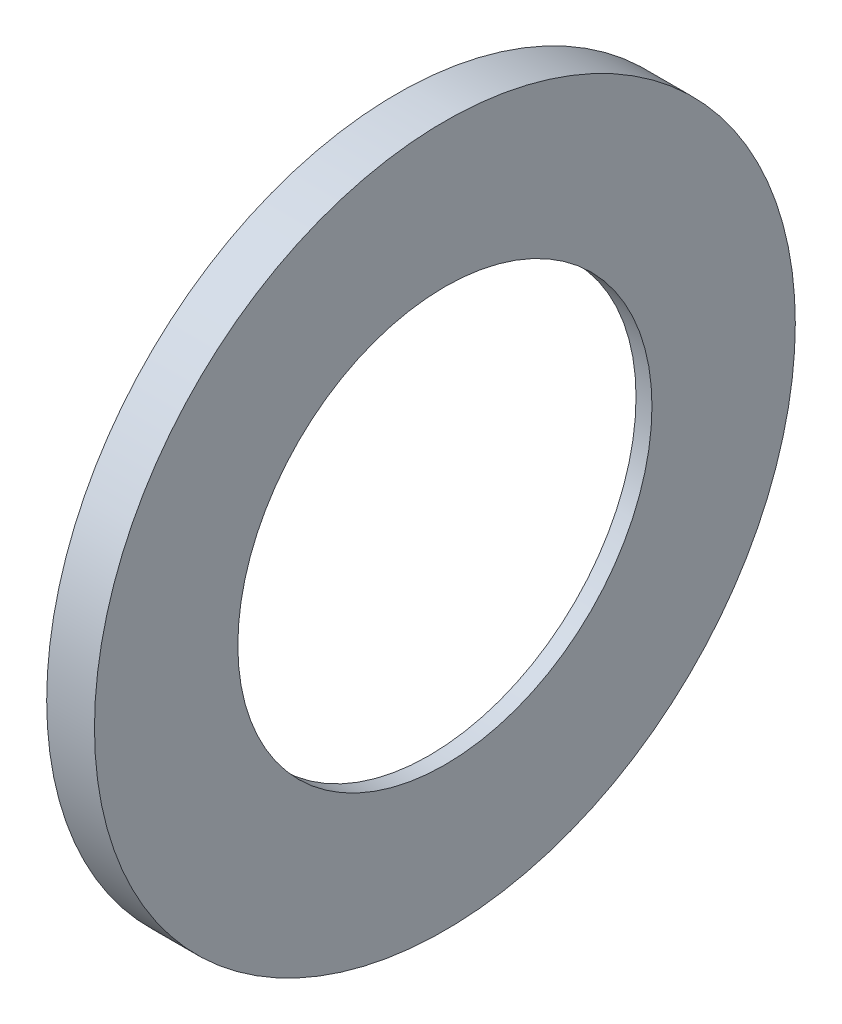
from build123d import *


with BuildPart() as part:
    # Esquisse1 → couronne (revolve)
    with BuildSketch(Plane.XY, mode=Mode.PRIVATE) as couronne_sk:
        Polygon((2, 13), (3, 13), (3, 22), (0, 22), (0, 21), (2, 21), align=None)
    revolve(couronne_sk.sketch.rotate(Axis((0, 0, 0), (1, 0, 0)), 90), axis=Axis((0, 0, 0), (1, 0, 0)))


solid = part.part
